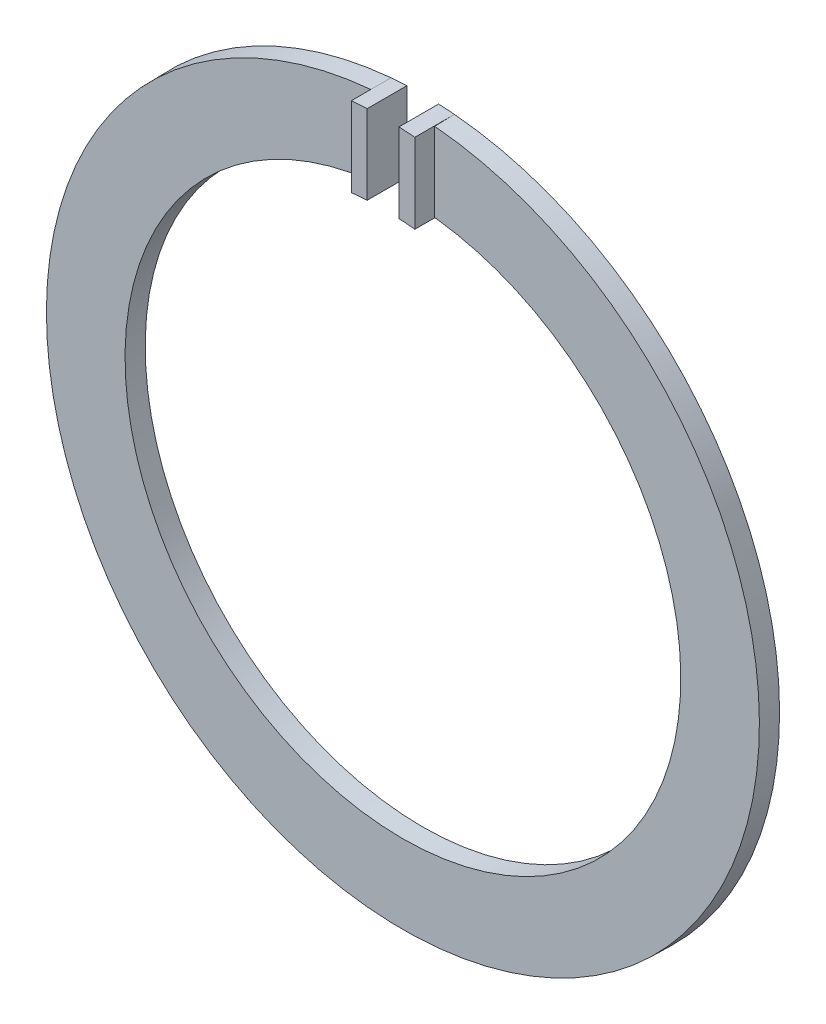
ISO-10303-21;
HEADER;
FILE_DESCRIPTION(('STEP AP214'),'2;1');
FILE_NAME('part.step','',(''),(''),'','','');
FILE_SCHEMA(('AUTOMOTIVE_DESIGN { 1 0 10303 214 1 1 1 1 }'));
ENDSEC;
DATA;
#1=APPLICATION_CONTEXT('core data for automotive mechanical design processes');
#2=APPLICATION_PROTOCOL_DEFINITION('international standard','automotive_design',2000,#1);
#3=PRODUCT_CONTEXT('',#1,'mechanical');
#4=PRODUCT('Part','Part','',(#3));
#5=PRODUCT_RELATED_PRODUCT_CATEGORY('part','',(#4));
#6=PRODUCT_DEFINITION_FORMATION('','',#4);
#7=PRODUCT_DEFINITION_CONTEXT('part definition',#1,'design');
#8=PRODUCT_DEFINITION('design','',#6,#7);
#9=PRODUCT_DEFINITION_SHAPE('','',#8);
#10=(LENGTH_UNIT() NAMED_UNIT(*) SI_UNIT(.MILLI.,.METRE.));
#11=(NAMED_UNIT(*) PLANE_ANGLE_UNIT() SI_UNIT($,.RADIAN.));
#12=(NAMED_UNIT(*) SI_UNIT($,.STERADIAN.) SOLID_ANGLE_UNIT());
#13=UNCERTAINTY_MEASURE_WITH_UNIT(LENGTH_MEASURE(1.E-05),#10,'distance_accuracy_value','');
#14=(GEOMETRIC_REPRESENTATION_CONTEXT(3) GLOBAL_UNCERTAINTY_ASSIGNED_CONTEXT((#13)) GLOBAL_UNIT_ASSIGNED_CONTEXT((#10,
#11,#12)) REPRESENTATION_CONTEXT('',''));
#15=CARTESIAN_POINT('',(0.,0.,0.));
#16=DIRECTION('',(0.,0.,1.));
#17=DIRECTION('',(1.,0.,0.));
#18=AXIS2_PLACEMENT_3D('',#15,#16,#17);
#19=CARTESIAN_POINT('',(0.,0.,3.175));
#20=DIRECTION('',(0.,0.,1.));
#21=DIRECTION('',(1.,0.,0.));
#22=AXIS2_PLACEMENT_3D('',#19,#20,#21);
#23=PLANE('',#22);
#24=DIRECTION('',(0.,-1.,0.));
#25=VECTOR('',#24,1.);
#26=CARTESIAN_POINT('',(-5.08,0.,3.175));
#27=LINE('',#26,#25);
#28=CARTESIAN_POINT('',(-5.08,56.8681341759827,3.175));
#29=VERTEX_POINT('',#28);
#30=CARTESIAN_POINT('',(-5.08,44.2145450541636,3.175));
#31=VERTEX_POINT('',#30);
#32=EDGE_CURVE('E140',#29,#31,#27,.T.);
#33=ORIENTED_EDGE('',*,*,#32,.F.);
#34=CARTESIAN_POINT('',(0.,0.,3.175));
#35=DIRECTION('',(0.,0.,1.));
#36=DIRECTION('',(1.,0.,0.));
#37=AXIS2_PLACEMENT_3D('',#34,#35,#36);
#38=CIRCLE('',#37,57.0945801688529);
#39=CARTESIAN_POINT('',(5.08,56.8681341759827,3.175));
#40=VERTEX_POINT('',#39);
#41=EDGE_CURVE('E210',#29,#40,#38,.T.);
#42=ORIENTED_EDGE('',*,*,#41,.T.);
#43=DIRECTION('',(0.,1.,0.));
#44=VECTOR('',#43,1.);
#45=CARTESIAN_POINT('',(5.08,0.,3.175));
#46=LINE('',#45,#44);
#47=CARTESIAN_POINT('',(5.08,44.2145450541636,3.175));
#48=VERTEX_POINT('',#47);
#49=EDGE_CURVE('E195',#48,#40,#46,.T.);
#50=ORIENTED_EDGE('',*,*,#49,.F.);
#51=CARTESIAN_POINT('',(0.,0.,3.175));
#52=DIRECTION('',(0.,0.,1.));
#53=DIRECTION('',(1.,0.,0.));
#54=AXIS2_PLACEMENT_3D('',#51,#52,#53);
#55=CIRCLE('',#54,44.5054198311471);
#56=EDGE_CURVE('E206',#31,#48,#55,.T.);
#57=ORIENTED_EDGE('',*,*,#56,.F.);
#58=EDGE_LOOP('',(#33,#42,#50,#57));
#59=FACE_BOUND('',#58,.T.);
#60=ADVANCED_FACE('F33',(#59),#23,.T.);
#61=CARTESIAN_POINT('',(0.,0.,0.));
#62=DIRECTION('',(0.,0.,1.));
#63=DIRECTION('',(1.,0.,0.));
#64=AXIS2_PLACEMENT_3D('',#61,#62,#63);
#65=PLANE('',#64);
#66=CARTESIAN_POINT('',(0.,0.,0.));
#67=DIRECTION('',(0.,0.,1.));
#68=DIRECTION('',(1.,0.,0.));
#69=AXIS2_PLACEMENT_3D('',#66,#67,#68);
#70=CIRCLE('',#69,57.15);
#71=CARTESIAN_POINT('',(-5.07999999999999,56.923774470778,0.));
#72=VERTEX_POINT('',#71);
#73=CARTESIAN_POINT('',(5.08,56.923774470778,0.));
#74=VERTEX_POINT('',#73);
#75=EDGE_CURVE('E211',#72,#74,#70,.T.);
#76=ORIENTED_EDGE('',*,*,#75,.F.);
#77=CARTESIAN_POINT('',(-2.54,57.0935276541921,0.));
#78=VERTEX_POINT('',#77);
#79=EDGE_CURVE('E207',#78,#72,#70,.T.);
#80=ORIENTED_EDGE('',*,*,#79,.F.);
#81=DIRECTION('',(0.,-1.,0.));
#82=VECTOR('',#81,1.);
#83=CARTESIAN_POINT('',(-2.54,40.7373016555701,0.));
#84=LINE('',#83,#82);
#85=CARTESIAN_POINT('',(-2.54,44.3773692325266,0.));
#86=VERTEX_POINT('',#85);
#87=EDGE_CURVE('E194',#78,#86,#84,.T.);
#88=ORIENTED_EDGE('',*,*,#87,.T.);
#89=CARTESIAN_POINT('',(0.,0.,0.));
#90=DIRECTION('',(0.,0.,1.));
#91=DIRECTION('',(1.,0.,0.));
#92=AXIS2_PLACEMENT_3D('',#89,#90,#91);
#93=CIRCLE('',#92,44.45);
#94=CARTESIAN_POINT('',(-5.08,44.1587601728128,0.));
#95=VERTEX_POINT('',#94);
#96=EDGE_CURVE('E203',#86,#95,#93,.T.);
#97=ORIENTED_EDGE('',*,*,#96,.T.);
#98=CARTESIAN_POINT('',(5.08,44.1587601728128,0.));
#99=VERTEX_POINT('',#98);
#100=EDGE_CURVE('E202',#95,#99,#93,.T.);
#101=ORIENTED_EDGE('',*,*,#100,.T.);
#102=CARTESIAN_POINT('',(0.,0.,0.));
#103=DIRECTION('',(0.,0.,1.));
#104=DIRECTION('',(-1.,0.,0.));
#105=AXIS2_PLACEMENT_3D('',#102,#103,#104);
#106=CIRCLE('',#105,44.45);
#107=CARTESIAN_POINT('',(2.54,44.3773692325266,0.));
#108=VERTEX_POINT('',#107);
#109=EDGE_CURVE('E237',#99,#108,#106,.T.);
#110=ORIENTED_EDGE('',*,*,#109,.T.);
#111=DIRECTION('',(0.,1.,0.));
#112=VECTOR('',#111,1.);
#113=CARTESIAN_POINT('',(2.54,40.7373016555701,0.));
#114=LINE('',#113,#112);
#115=CARTESIAN_POINT('',(2.54,57.0935276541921,0.));
#116=VERTEX_POINT('',#115);
#117=EDGE_CURVE('E199',#108,#116,#114,.T.);
#118=ORIENTED_EDGE('',*,*,#117,.T.);
#119=CARTESIAN_POINT('',(0.,0.,0.));
#120=DIRECTION('',(0.,0.,-1.));
#121=DIRECTION('',(-1.,0.,0.));
#122=AXIS2_PLACEMENT_3D('',#119,#120,#121);
#123=CIRCLE('',#122,57.15);
#124=EDGE_CURVE('E151',#116,#74,#123,.T.);
#125=ORIENTED_EDGE('',*,*,#124,.T.);
#126=EDGE_LOOP('',(#76,#80,#88,#97,#101,#110,#118,#125));
#127=FACE_BOUND('',#126,.T.);
#128=ADVANCED_FACE('F235',(#127),#65,.F.);
#129=CARTESIAN_POINT('',(0.,0.,0.));
#130=DIRECTION('',(0.,0.,-1.));
#131=DIRECTION('',(1.,0.,0.));
#132=AXIS2_PLACEMENT_3D('',#129,#130,#131);
#133=CONICAL_SURFACE('',#132,57.15,0.0174532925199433);
#134=ORIENTED_EDGE('',*,*,#41,.F.);
#135=CARTESIAN_POINT('',(-5.08,56.4596381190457,26.4842370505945));
#136=CARTESIAN_POINT('',(-5.08,56.6049207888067,18.1944823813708));
#137=CARTESIAN_POINT('',(-5.08,56.7501990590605,9.90472763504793));
#138=CARTESIAN_POINT('',(-5.08,57.0407468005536,-6.67478201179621));
#139=CARTESIAN_POINT('',(-5.08,57.1860162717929,-14.9645369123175));
#140=CARTESIAN_POINT('',(-5.08,57.3312813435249,-23.2542918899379));
#141=B_SPLINE_CURVE_WITH_KNOTS('',3,(#135,#136,#137,#138,#139,#140),.UNSPECIFIED.,.F.,.F.,(4,2,
4),(0.,24.8730829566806,49.7461659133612),.UNSPECIFIED.);
#142=EDGE_CURVE('E145',#29,#72,#141,.T.);
#143=ORIENTED_EDGE('',*,*,#142,.T.);
#144=ORIENTED_EDGE('',*,*,#75,.T.);
#145=CARTESIAN_POINT('',(5.08,57.3312813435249,-23.2542918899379));
#146=CARTESIAN_POINT('',(5.08,57.1860162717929,-14.9645369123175));
#147=CARTESIAN_POINT('',(5.08,57.0407468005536,-6.67478201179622));
#148=CARTESIAN_POINT('',(5.08,56.7501990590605,9.90472763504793));
#149=CARTESIAN_POINT('',(5.08,56.6049207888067,18.1944823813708));
#150=CARTESIAN_POINT('',(5.08,56.4596381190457,26.4842370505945));
#151=B_SPLINE_CURVE_WITH_KNOTS('',3,(#145,#146,#147,#148,#149,#150),.UNSPECIFIED.,.F.,.F.,(4,2,
4),(0.,24.8730829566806,49.7461659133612),.UNSPECIFIED.);
#152=EDGE_CURVE('E187',#74,#40,#151,.T.);
#153=ORIENTED_EDGE('',*,*,#152,.T.);
#154=EDGE_LOOP('',(#134,#143,#144,#153));
#155=FACE_BOUND('',#154,.T.);
#156=ADVANCED_FACE('F154',(#155),#133,.T.);
#157=CARTESIAN_POINT('',(0.,0.,0.));
#158=DIRECTION('',(0.,0.,1.));
#159=DIRECTION('',(1.,0.,0.));
#160=AXIS2_PLACEMENT_3D('',#157,#158,#159);
#161=CONICAL_SURFACE('',#160,44.45,0.0174532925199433);
#162=CARTESIAN_POINT('',(-5.08,44.2672042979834,6.17215203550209));
#163=CARTESIAN_POINT('',(-5.08,44.2333945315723,4.24782129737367));
#164=CARTESIAN_POINT('',(-5.08,44.1995842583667,2.32349056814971));
#165=CARTESIAN_POINT('',(-5.08,44.1319626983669,-1.52517087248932));
#166=CARTESIAN_POINT('',(-5.08,44.0981514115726,-3.44950158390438));
#167=CARTESIAN_POINT('',(-5.08,44.064339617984,-5.37383228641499));
#168=B_SPLINE_CURVE_WITH_KNOTS('',3,(#162,#163,#164,#165,#166,#167),.UNSPECIFIED.,.F.,.F.,(4,2,
4),(0.,5.77388318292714,11.5477663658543),.UNSPECIFIED.);
#169=EDGE_CURVE('E11',#31,#95,#168,.T.);
#170=ORIENTED_EDGE('',*,*,#169,.F.);
#171=ORIENTED_EDGE('',*,*,#56,.T.);
#172=CARTESIAN_POINT('',(5.08,44.064339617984,-5.37383228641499));
#173=CARTESIAN_POINT('',(5.08,44.0981514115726,-3.44950158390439));
#174=CARTESIAN_POINT('',(5.08,44.1319626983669,-1.52517087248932));
#175=CARTESIAN_POINT('',(5.08,44.1995842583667,2.32349056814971));
#176=CARTESIAN_POINT('',(5.08,44.2333945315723,4.24782129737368));
#177=CARTESIAN_POINT('',(5.08,44.2672042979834,6.1721520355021));
#178=B_SPLINE_CURVE_WITH_KNOTS('',3,(#172,#173,#174,#175,#176,#177),.UNSPECIFIED.,.F.,.F.,(4,2,
4),(0.,5.77388318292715,11.5477663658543),.UNSPECIFIED.);
#179=EDGE_CURVE('E46',#99,#48,#178,.T.);
#180=ORIENTED_EDGE('',*,*,#179,.F.);
#181=ORIENTED_EDGE('',*,*,#100,.F.);
#182=EDGE_LOOP('',(#170,#171,#180,#181));
#183=FACE_BOUND('',#182,.T.);
#184=ADVANCED_FACE('F35',(#183),#161,.F.);
#185=CARTESIAN_POINT('',(-2.54,40.7373016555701,0.));
#186=DIRECTION('',(-1.,0.,0.));
#187=DIRECTION('',(0.,0.,1.));
#188=AXIS2_PLACEMENT_3D('',#185,#186,#187);
#189=PLANE('',#188);
#190=ORIENTED_EDGE('',*,*,#87,.F.);
#191=DIRECTION('',(0.,0.,-1.));
#192=VECTOR('',#191,1.);
#193=CARTESIAN_POINT('',(-2.54,57.0935276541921,6.35));
#194=LINE('',#193,#192);
#195=CARTESIAN_POINT('',(-2.54,57.0935276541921,6.35));
#196=VERTEX_POINT('',#195);
#197=EDGE_CURVE('E141',#196,#78,#194,.T.);
#198=ORIENTED_EDGE('',*,*,#197,.F.);
#199=DIRECTION('',(0.,-1.,0.));
#200=VECTOR('',#199,1.);
#201=CARTESIAN_POINT('',(-2.54,44.3773692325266,6.35));
#202=LINE('',#201,#200);
#203=CARTESIAN_POINT('',(-2.54,44.3773692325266,6.35));
#204=VERTEX_POINT('',#203);
#205=EDGE_CURVE('E121',#196,#204,#202,.T.);
#206=ORIENTED_EDGE('',*,*,#205,.T.);
#207=DIRECTION('',(0.,0.,-1.));
#208=VECTOR('',#207,1.);
#209=CARTESIAN_POINT('',(-2.54,44.3773692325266,6.35));
#210=LINE('',#209,#208);
#211=EDGE_CURVE('E134',#204,#86,#210,.T.);
#212=ORIENTED_EDGE('',*,*,#211,.T.);
#213=EDGE_LOOP('',(#190,#198,#206,#212));
#214=FACE_BOUND('',#213,.T.);
#215=ADVANCED_FACE('F251',(#214),#189,.F.);
#216=CARTESIAN_POINT('',(2.54,40.7373016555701,0.));
#217=DIRECTION('',(1.,0.,0.));
#218=DIRECTION('',(0.,0.,-1.));
#219=AXIS2_PLACEMENT_3D('',#216,#217,#218);
#220=PLANE('',#219);
#221=ORIENTED_EDGE('',*,*,#117,.F.);
#222=DIRECTION('',(0.,0.,-1.));
#223=VECTOR('',#222,1.);
#224=CARTESIAN_POINT('',(2.54,44.3773692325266,6.35));
#225=LINE('',#224,#223);
#226=CARTESIAN_POINT('',(2.54,44.3773692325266,6.35));
#227=VERTEX_POINT('',#226);
#228=EDGE_CURVE('E60',#227,#108,#225,.T.);
#229=ORIENTED_EDGE('',*,*,#228,.F.);
#230=DIRECTION('',(0.,1.,0.));
#231=VECTOR('',#230,1.);
#232=CARTESIAN_POINT('',(2.54,57.0935276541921,6.35));
#233=LINE('',#232,#231);
#234=CARTESIAN_POINT('',(2.54,57.0935276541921,6.35));
#235=VERTEX_POINT('',#234);
#236=EDGE_CURVE('E234',#227,#235,#233,.T.);
#237=ORIENTED_EDGE('',*,*,#236,.T.);
#238=DIRECTION('',(0.,0.,-1.));
#239=VECTOR('',#238,1.);
#240=CARTESIAN_POINT('',(2.54,57.0935276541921,6.35));
#241=LINE('',#240,#239);
#242=EDGE_CURVE('E243',#235,#116,#241,.T.);
#243=ORIENTED_EDGE('',*,*,#242,.T.);
#244=EDGE_LOOP('',(#221,#229,#237,#243));
#245=FACE_BOUND('',#244,.T.);
#246=ADVANCED_FACE('F178',(#245),#220,.F.);
#247=CARTESIAN_POINT('',(5.08,56.923774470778,6.35));
#248=DIRECTION('',(1.,0.,0.));
#249=DIRECTION('',(0.,0.,-1.));
#250=AXIS2_PLACEMENT_3D('',#247,#248,#249);
#251=PLANE('',#250);
#252=ORIENTED_EDGE('',*,*,#152,.F.);
#253=DIRECTION('',(0.,0.,-1.));
#254=VECTOR('',#253,1.);
#255=CARTESIAN_POINT('',(5.08,56.923774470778,6.35));
#256=LINE('',#255,#254);
#257=CARTESIAN_POINT('',(5.08,56.923774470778,6.35));
#258=VERTEX_POINT('',#257);
#259=EDGE_CURVE('E226',#258,#74,#256,.T.);
#260=ORIENTED_EDGE('',*,*,#259,.F.);
#261=DIRECTION('',(0.,-1.,0.));
#262=VECTOR('',#261,1.);
#263=CARTESIAN_POINT('',(5.08,56.923774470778,6.35));
#264=LINE('',#263,#262);
#265=CARTESIAN_POINT('',(5.08,44.1587601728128,6.35));
#266=VERTEX_POINT('',#265);
#267=EDGE_CURVE('E247',#258,#266,#264,.T.);
#268=ORIENTED_EDGE('',*,*,#267,.T.);
#269=DIRECTION('',(0.,0.,-1.));
#270=VECTOR('',#269,1.);
#271=CARTESIAN_POINT('',(5.08,44.1587601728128,6.35));
#272=LINE('',#271,#270);
#273=EDGE_CURVE('E233',#266,#99,#272,.T.);
#274=ORIENTED_EDGE('',*,*,#273,.T.);
#275=ORIENTED_EDGE('',*,*,#179,.T.);
#276=ORIENTED_EDGE('',*,*,#49,.T.);
#277=EDGE_LOOP('',(#252,#260,#268,#274,#275,#276));
#278=FACE_BOUND('',#277,.T.);
#279=ADVANCED_FACE('F174',(#278),#251,.T.);
#280=CARTESIAN_POINT('',(0.,0.,6.35));
#281=DIRECTION('',(0.,0.,-1.));
#282=DIRECTION('',(-1.,0.,0.));
#283=AXIS2_PLACEMENT_3D('',#280,#281,#282);
#284=CYLINDRICAL_SURFACE('',#283,57.15);
#285=ORIENTED_EDGE('',*,*,#124,.F.);
#286=ORIENTED_EDGE('',*,*,#242,.F.);
#287=CARTESIAN_POINT('',(0.,0.,6.35));
#288=DIRECTION('',(0.,0.,-1.));
#289=DIRECTION('',(-1.,0.,0.));
#290=AXIS2_PLACEMENT_3D('',#287,#288,#289);
#291=CIRCLE('',#290,57.15);
#292=EDGE_CURVE('E152',#235,#258,#291,.T.);
#293=ORIENTED_EDGE('',*,*,#292,.T.);
#294=ORIENTED_EDGE('',*,*,#259,.T.);
#295=EDGE_LOOP('',(#285,#286,#293,#294));
#296=FACE_BOUND('',#295,.T.);
#297=ADVANCED_FACE('F173',(#296),#284,.T.);
#298=CARTESIAN_POINT('',(0.,0.,6.35));
#299=DIRECTION('',(0.,0.,-1.));
#300=DIRECTION('',(-1.,0.,0.));
#301=AXIS2_PLACEMENT_3D('',#298,#299,#300);
#302=CYLINDRICAL_SURFACE('',#301,44.45);
#303=ORIENTED_EDGE('',*,*,#109,.F.);
#304=ORIENTED_EDGE('',*,*,#273,.F.);
#305=CARTESIAN_POINT('',(0.,0.,6.35));
#306=DIRECTION('',(0.,0.,1.));
#307=DIRECTION('',(-1.,0.,0.));
#308=AXIS2_PLACEMENT_3D('',#305,#306,#307);
#309=CIRCLE('',#308,44.45);
#310=EDGE_CURVE('E268',#266,#227,#309,.T.);
#311=ORIENTED_EDGE('',*,*,#310,.T.);
#312=ORIENTED_EDGE('',*,*,#228,.T.);
#313=EDGE_LOOP('',(#303,#304,#311,#312));
#314=FACE_BOUND('',#313,.T.);
#315=ADVANCED_FACE('F169',(#314),#302,.F.);
#316=CARTESIAN_POINT('',(0.,0.,6.35));
#317=DIRECTION('',(0.,0.,-1.));
#318=DIRECTION('',(-1.,0.,0.));
#319=AXIS2_PLACEMENT_3D('',#316,#317,#318);
#320=PLANE('',#319);
#321=ORIENTED_EDGE('',*,*,#292,.F.);
#322=ORIENTED_EDGE('',*,*,#236,.F.);
#323=ORIENTED_EDGE('',*,*,#310,.F.);
#324=ORIENTED_EDGE('',*,*,#267,.F.);
#325=EDGE_LOOP('',(#321,#322,#323,#324));
#326=FACE_BOUND('',#325,.T.);
#327=ADVANCED_FACE('F161',(#326),#320,.F.);
#328=CARTESIAN_POINT('',(-5.08,44.1587601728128,6.35));
#329=DIRECTION('',(-1.,0.,0.));
#330=DIRECTION('',(0.,0.,1.));
#331=AXIS2_PLACEMENT_3D('',#328,#329,#330);
#332=PLANE('',#331);
#333=ORIENTED_EDGE('',*,*,#142,.F.);
#334=ORIENTED_EDGE('',*,*,#32,.T.);
#335=ORIENTED_EDGE('',*,*,#169,.T.);
#336=DIRECTION('',(0.,0.,-1.));
#337=VECTOR('',#336,1.);
#338=CARTESIAN_POINT('',(-5.08,44.1587601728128,6.35));
#339=LINE('',#338,#337);
#340=CARTESIAN_POINT('',(-5.08,44.1587601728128,6.35));
#341=VERTEX_POINT('',#340);
#342=EDGE_CURVE('E53',#341,#95,#339,.T.);
#343=ORIENTED_EDGE('',*,*,#342,.F.);
#344=DIRECTION('',(0.,1.,0.));
#345=VECTOR('',#344,1.);
#346=CARTESIAN_POINT('',(-5.08,44.1587601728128,6.35));
#347=LINE('',#346,#345);
#348=CARTESIAN_POINT('',(-5.07999999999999,56.923774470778,6.35));
#349=VERTEX_POINT('',#348);
#350=EDGE_CURVE('E117',#341,#349,#347,.T.);
#351=ORIENTED_EDGE('',*,*,#350,.T.);
#352=DIRECTION('',(0.,0.,-1.));
#353=VECTOR('',#352,1.);
#354=CARTESIAN_POINT('',(-5.07999999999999,56.923774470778,6.35));
#355=LINE('',#354,#353);
#356=EDGE_CURVE('E120',#349,#72,#355,.T.);
#357=ORIENTED_EDGE('',*,*,#356,.T.);
#358=EDGE_LOOP('',(#333,#334,#335,#343,#351,#357));
#359=FACE_BOUND('',#358,.T.);
#360=ADVANCED_FACE('F116',(#359),#332,.T.);
#361=CARTESIAN_POINT('',(0.,0.,6.35));
#362=DIRECTION('',(0.,0.,-1.));
#363=DIRECTION('',(-1.,0.,0.));
#364=AXIS2_PLACEMENT_3D('',#361,#362,#363);
#365=CYLINDRICAL_SURFACE('',#364,44.45);
#366=ORIENTED_EDGE('',*,*,#96,.F.);
#367=ORIENTED_EDGE('',*,*,#211,.F.);
#368=CARTESIAN_POINT('',(0.,0.,6.35));
#369=DIRECTION('',(0.,0.,1.));
#370=DIRECTION('',(-1.,0.,0.));
#371=AXIS2_PLACEMENT_3D('',#368,#369,#370);
#372=CIRCLE('',#371,44.45);
#373=EDGE_CURVE('E128',#204,#341,#372,.T.);
#374=ORIENTED_EDGE('',*,*,#373,.T.);
#375=ORIENTED_EDGE('',*,*,#342,.T.);
#376=EDGE_LOOP('',(#366,#367,#374,#375));
#377=FACE_BOUND('',#376,.T.);
#378=ADVANCED_FACE('F133',(#377),#365,.F.);
#379=CARTESIAN_POINT('',(0.,0.,6.35));
#380=DIRECTION('',(0.,0.,-1.));
#381=DIRECTION('',(-1.,0.,0.));
#382=AXIS2_PLACEMENT_3D('',#379,#380,#381);
#383=CYLINDRICAL_SURFACE('',#382,57.15);
#384=ORIENTED_EDGE('',*,*,#79,.T.);
#385=ORIENTED_EDGE('',*,*,#356,.F.);
#386=CARTESIAN_POINT('',(0.,0.,6.35));
#387=DIRECTION('',(0.,0.,-1.));
#388=DIRECTION('',(-1.,0.,0.));
#389=AXIS2_PLACEMENT_3D('',#386,#387,#388);
#390=CIRCLE('',#389,57.15);
#391=EDGE_CURVE('E131',#349,#196,#390,.T.);
#392=ORIENTED_EDGE('',*,*,#391,.T.);
#393=ORIENTED_EDGE('',*,*,#197,.T.);
#394=EDGE_LOOP('',(#384,#385,#392,#393));
#395=FACE_BOUND('',#394,.T.);
#396=ADVANCED_FACE('F162',(#395),#383,.T.);
#397=CARTESIAN_POINT('',(0.,0.,6.35));
#398=DIRECTION('',(0.,0.,-1.));
#399=DIRECTION('',(-1.,0.,0.));
#400=AXIS2_PLACEMENT_3D('',#397,#398,#399);
#401=PLANE('',#400);
#402=ORIENTED_EDGE('',*,*,#373,.F.);
#403=ORIENTED_EDGE('',*,*,#205,.F.);
#404=ORIENTED_EDGE('',*,*,#391,.F.);
#405=ORIENTED_EDGE('',*,*,#350,.F.);
#406=EDGE_LOOP('',(#402,#403,#404,#405));
#407=FACE_BOUND('',#406,.T.);
#408=ADVANCED_FACE('F126',(#407),#401,.F.);
#409=CLOSED_SHELL('',(#60,#128,#156,#184,#215,#246,#279,#297,#315,#327,#360,#378,#396,#408));
#410=MANIFOLD_SOLID_BREP('B2',#409);
#411=ADVANCED_BREP_SHAPE_REPRESENTATION('',(#18,#410),#14);
#412=SHAPE_DEFINITION_REPRESENTATION(#9,#411);
ENDSEC;
END-ISO-10303-21;
